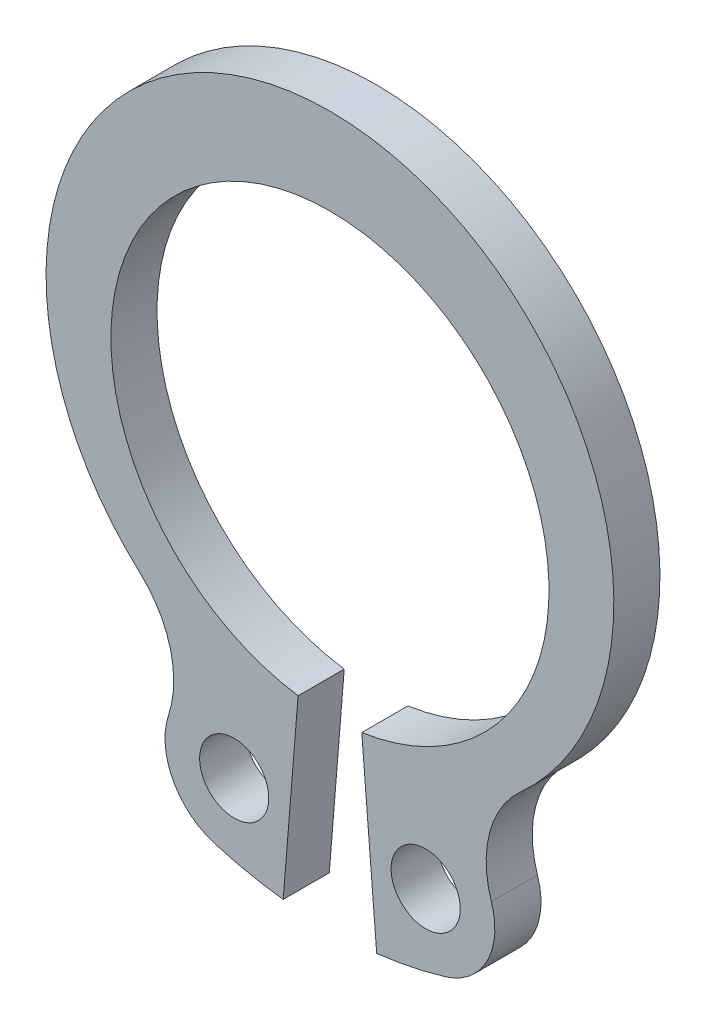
from build123d import *

# Parameters (mm, degrees)
ESQUISSE1_R          = 0.6
BASE_EXTRUSION_DEPTH = 0.8


with BuildPart() as part:
    # Esquisse1 → Base-Extrusion (new body)
    with BuildSketch(Plane.XY):
        with BuildLine():
            Line((0.552363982, -3.759640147), (0.811170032, -6.949157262))
            ThreePointArc((0.811170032, -6.949157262), (1.413428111, -6.8520803), (2.004940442, -6.702909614))
            ThreePointArc((2.004940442, -6.702909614), (2.725024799, -6.108190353), (2.800660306, -5.177334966))
            ThreePointArc((2.800660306, -5.177334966), (2.769896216, -4.153252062), (3.302910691, -3.278273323))
            ThreePointArc((3.302910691, -3.278273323), (0, 5.3), (-3.302910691, -3.278273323))
            ThreePointArc((-3.302910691, -3.278273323), (-2.769896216, -4.153252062), (-2.800660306, -5.177334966))
            ThreePointArc((-2.800660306, -5.177334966), (-2.725024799, -6.108190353), (-2.004940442, -6.702909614))
            ThreePointArc((-2.004940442, -6.702909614), (-1.413428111, -6.8520803), (-0.811170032, -6.949157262))
            Line((-0.811170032, -6.949157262), (-0.552363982, -3.759640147))
            ThreePointArc((-0.552363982, -3.759640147), (0, 3.8), (0.552363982, -3.759640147))
        make_face()
        with Locations((1.661056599, -5.553238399)):
            Circle(ESQUISSE1_R, mode=Mode.SUBTRACT)
        with Locations(Location((-1.661056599, -5.553238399, 0), (0, 0, 180))):
            Circle(ESQUISSE1_R, mode=Mode.SUBTRACT)
    extrude(amount=BASE_EXTRUSION_DEPTH)


solid = part.part
